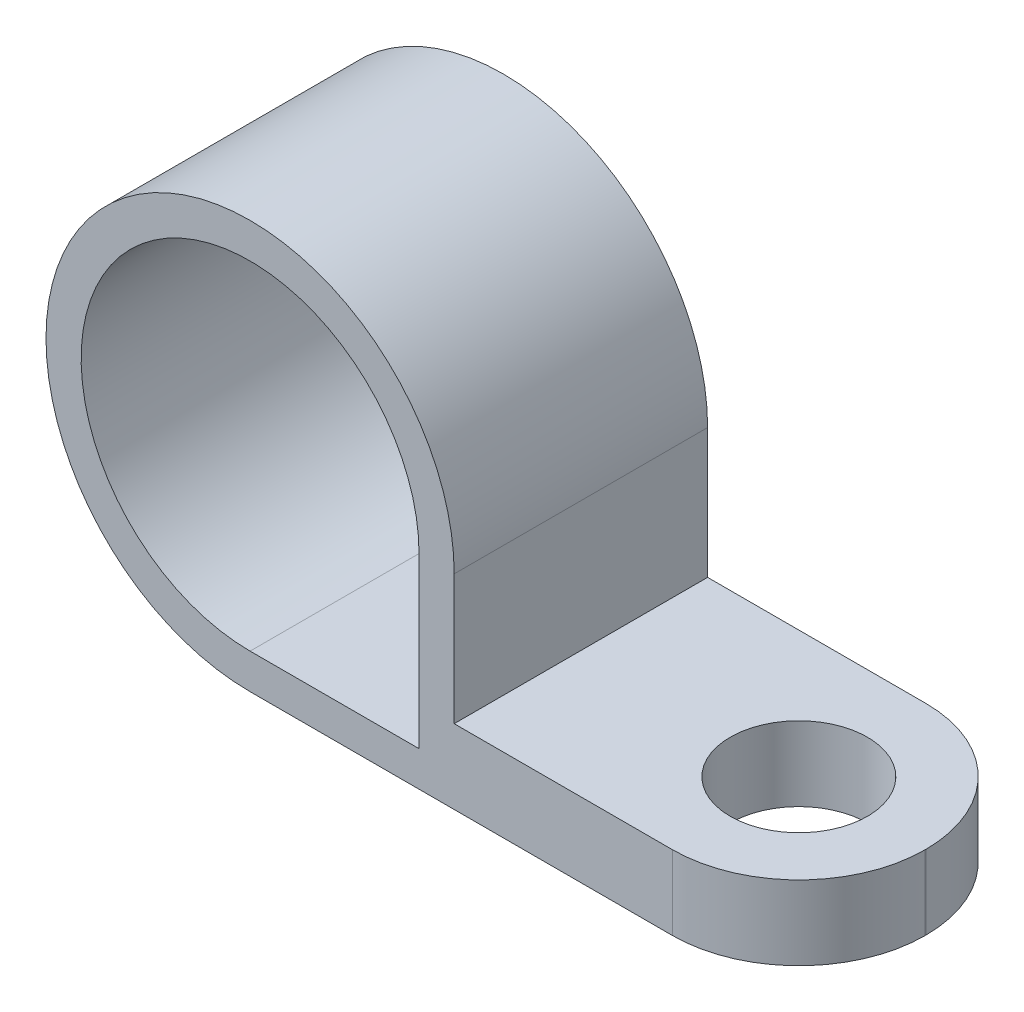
from build123d import *

# Parameters (mm, degrees)
EXTRUDE1_DEPTH     = 4.7625
FILLET1_R          = 4.7498
CUT_EXTRUDE1_START = -2.794
SKETCH3_R          = 2.5781
CUT_EXTRUDE1_DEPTH = 2.794


with BuildPart() as part:
    # Sketch1 → Extrude1 (new, symmetric)
    with BuildSketch(Plane.XY):
        with BuildLine():
            Line((0, -7.6708), (20.6248, -7.6708))
            Line((20.6248, -7.6708), (20.6248, -4.8768))
            Line((20.6248, -4.8768), (7.6708, -4.8768))
            Line((7.6708, -4.8768), (7.6708, 0))
            ThreePointArc((7.6708, 0), (-5.424074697, 5.424074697), (0, -7.6708))
        make_face()
        with BuildLine():
            Line((6.35, 0), (6.35, -6.35))
            Line((6.35, -6.35), (0, -6.35))
            ThreePointArc((0, -6.35), (-4.490128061, 4.490128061), (6.35, 0))
        make_face(mode=Mode.SUBTRACT)
    extrude(amount=EXTRUDE1_DEPTH, both=True)

    # Fillet1
    fillet1_edges = [part.edges().sort_by_distance(p)[0] for p in [
        (20.6248, -6.2738, 4.7625),
        (20.6248, -6.2738, -4.7625),
    ]]
    fillet(fillet1_edges, radius=FILLET1_R)

    # Sketch3 → Cut-Extrude1 (cut)
    with BuildSketch(Plane(origin=(0, -4.8768, 0), x_dir=(-1, 0, 0), z_dir=(0, 1, 0)).offset(CUT_EXTRUDE1_START)):
        with Locations(Location((-15.875, 0.0127, 0), (0, 0, 90))):
            Circle(SKETCH3_R)
    extrude(amount=CUT_EXTRUDE1_DEPTH, mode=Mode.SUBTRACT)


solid = part.part
